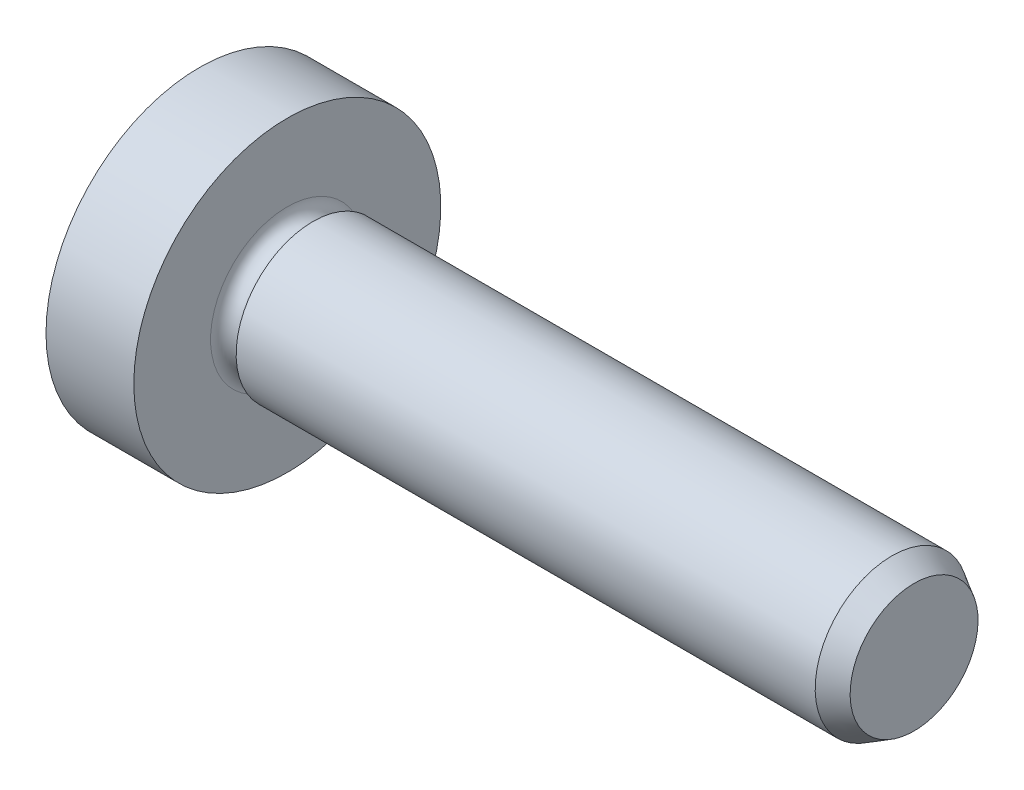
ISO-10303-21;
HEADER;
FILE_DESCRIPTION(('STEP AP214'),'2;1');
FILE_NAME('part.step','',(''),(''),'','','');
FILE_SCHEMA(('AUTOMOTIVE_DESIGN { 1 0 10303 214 1 1 1 1 }'));
ENDSEC;
DATA;
#1=APPLICATION_CONTEXT('core data for automotive mechanical design processes');
#2=APPLICATION_PROTOCOL_DEFINITION('international standard','automotive_design',2000,#1);
#3=PRODUCT_CONTEXT('',#1,'mechanical');
#4=PRODUCT('Part','Part','',(#3));
#5=PRODUCT_RELATED_PRODUCT_CATEGORY('part','',(#4));
#6=PRODUCT_DEFINITION_FORMATION('','',#4);
#7=PRODUCT_DEFINITION_CONTEXT('part definition',#1,'design');
#8=PRODUCT_DEFINITION('design','',#6,#7);
#9=PRODUCT_DEFINITION_SHAPE('','',#8);
#10=(LENGTH_UNIT() NAMED_UNIT(*) SI_UNIT(.MILLI.,.METRE.));
#11=(NAMED_UNIT(*) PLANE_ANGLE_UNIT() SI_UNIT($,.RADIAN.));
#12=(NAMED_UNIT(*) SI_UNIT($,.STERADIAN.) SOLID_ANGLE_UNIT());
#13=UNCERTAINTY_MEASURE_WITH_UNIT(LENGTH_MEASURE(1.E-05),#10,'distance_accuracy_value','');
#14=(GEOMETRIC_REPRESENTATION_CONTEXT(3) GLOBAL_UNCERTAINTY_ASSIGNED_CONTEXT((#13)) GLOBAL_UNIT_ASSIGNED_CONTEXT((#10,
#11,#12)) REPRESENTATION_CONTEXT('',''));
#15=CARTESIAN_POINT('',(0.,0.,0.));
#16=DIRECTION('',(0.,0.,1.));
#17=DIRECTION('',(1.,0.,0.));
#18=AXIS2_PLACEMENT_3D('',#15,#16,#17);
#19=CARTESIAN_POINT('',(16.,0.,0.));
#20=DIRECTION('',(-1.,0.,0.));
#21=DIRECTION('',(0.,1.,0.));
#22=AXIS2_PLACEMENT_3D('',#19,#20,#21);
#23=SPHERICAL_SURFACE('',#22,16.);
#24=CARTESIAN_POINT('',(1.16760302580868,0.,0.));
#25=DIRECTION('',(-1.,0.,0.));
#26=DIRECTION('',(0.,0.,1.));
#27=AXIS2_PLACEMENT_3D('',#24,#25,#26);
#28=CIRCLE('',#27,6.);
#29=CARTESIAN_POINT('',(1.16760302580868,0.,6.));
#30=VERTEX_POINT('',#29);
#31=EDGE_CURVE('E133',#30,#30,#28,.T.);
#32=ORIENTED_EDGE('',*,*,#31,.T.);
#33=EDGE_LOOP('',(#32));
#34=FACE_BOUND('',#33,.T.);
#35=CARTESIAN_POINT('',(16.,0.,-0.690000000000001));
#36=DIRECTION('',(0.,0.,1.));
#37=DIRECTION('',(0.,-1.,0.));
#38=AXIS2_PLACEMENT_3D('',#35,#36,#37);
#39=CIRCLE('',#38,15.9851149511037);
#40=CARTESIAN_POINT('',(0.348506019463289,3.24878995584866,-0.69));
#41=VERTEX_POINT('',#40);
#42=CARTESIAN_POINT('',(0.0297839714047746,0.689999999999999,-0.690000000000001));
#43=VERTEX_POINT('',#42);
#44=EDGE_CURVE('E12',#41,#43,#39,.T.);
#45=ORIENTED_EDGE('',*,*,#44,.F.);
#46=CARTESIAN_POINT('',(13.4938938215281,-4.34070323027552,0.));
#47=DIRECTION('',(-0.500000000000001,-0.866025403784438,0.));
#48=DIRECTION('',(0.866025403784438,-0.500000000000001,0.));
#49=AXIS2_PLACEMENT_3D('',#46,#47,#48);
#50=CIRCLE('',#49,15.1946611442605);
#51=CARTESIAN_POINT('',(0.348506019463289,3.24878995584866,0.689999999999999));
#52=VERTEX_POINT('',#51);
#53=EDGE_CURVE('E48',#52,#41,#50,.T.);
#54=ORIENTED_EDGE('',*,*,#53,.F.);
#55=CARTESIAN_POINT('',(16.,0.,0.689999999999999));
#56=DIRECTION('',(0.,0.,-1.));
#57=DIRECTION('',(0.,1.,0.));
#58=AXIS2_PLACEMENT_3D('',#55,#56,#57);
#59=CIRCLE('',#58,15.9851149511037);
#60=CARTESIAN_POINT('',(0.0297839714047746,0.689999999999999,0.689999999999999));
#61=VERTEX_POINT('',#60);
#62=EDGE_CURVE('E145',#61,#52,#59,.T.);
#63=ORIENTED_EDGE('',*,*,#62,.F.);
#64=CARTESIAN_POINT('',(16.,0.689999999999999,0.));
#65=DIRECTION('',(0.,-1.,0.));
#66=DIRECTION('',(0.,0.,-1.));
#67=AXIS2_PLACEMENT_3D('',#64,#65,#66);
#68=CIRCLE('',#67,15.9851149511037);
#69=CARTESIAN_POINT('',(0.348506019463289,0.689999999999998,3.24878995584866));
#70=VERTEX_POINT('',#69);
#71=EDGE_CURVE('E186',#70,#61,#68,.T.);
#72=ORIENTED_EDGE('',*,*,#71,.F.);
#73=CARTESIAN_POINT('',(13.4938938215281,0.,-4.34070323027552));
#74=DIRECTION('',(-0.500000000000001,0.,-0.866025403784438));
#75=DIRECTION('',(-0.866025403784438,0.,0.500000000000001));
#76=AXIS2_PLACEMENT_3D('',#73,#74,#75);
#77=CIRCLE('',#76,15.1946611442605);
#78=CARTESIAN_POINT('',(0.348506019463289,-0.690000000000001,3.24878995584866));
#79=VERTEX_POINT('',#78);
#80=EDGE_CURVE('E185',#79,#70,#77,.T.);
#81=ORIENTED_EDGE('',*,*,#80,.F.);
#82=CARTESIAN_POINT('',(16.,-0.690000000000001,0.));
#83=DIRECTION('',(0.,1.,0.));
#84=DIRECTION('',(0.,0.,1.));
#85=AXIS2_PLACEMENT_3D('',#82,#83,#84);
#86=CIRCLE('',#85,15.9851149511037);
#87=CARTESIAN_POINT('',(0.0297839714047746,-0.690000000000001,0.689999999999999));
#88=VERTEX_POINT('',#87);
#89=EDGE_CURVE('E187',#88,#79,#86,.T.);
#90=ORIENTED_EDGE('',*,*,#89,.F.);
#91=CARTESIAN_POINT('',(16.,0.,0.689999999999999));
#92=DIRECTION('',(0.,0.,-1.));
#93=DIRECTION('',(0.,1.,0.));
#94=AXIS2_PLACEMENT_3D('',#91,#92,#93);
#95=CIRCLE('',#94,15.9851149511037);
#96=CARTESIAN_POINT('',(0.348506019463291,-3.24878995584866,0.689999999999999));
#97=VERTEX_POINT('',#96);
#98=EDGE_CURVE('E174',#97,#88,#95,.T.);
#99=ORIENTED_EDGE('',*,*,#98,.F.);
#100=CARTESIAN_POINT('',(13.4938938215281,4.34070323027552,0.));
#101=DIRECTION('',(-0.500000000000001,0.866025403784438,0.));
#102=DIRECTION('',(-0.866025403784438,-0.500000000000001,0.));
#103=AXIS2_PLACEMENT_3D('',#100,#101,#102);
#104=CIRCLE('',#103,15.1946611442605);
#105=CARTESIAN_POINT('',(0.348506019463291,-3.24878995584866,-0.690000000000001));
#106=VERTEX_POINT('',#105);
#107=EDGE_CURVE('E172',#106,#97,#104,.T.);
#108=ORIENTED_EDGE('',*,*,#107,.F.);
#109=CARTESIAN_POINT('',(16.,0.,-0.690000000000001));
#110=DIRECTION('',(0.,0.,1.));
#111=DIRECTION('',(0.,-1.,0.));
#112=AXIS2_PLACEMENT_3D('',#109,#110,#111);
#113=CIRCLE('',#112,15.9851149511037);
#114=CARTESIAN_POINT('',(0.0297839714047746,-0.690000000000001,-0.690000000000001));
#115=VERTEX_POINT('',#114);
#116=EDGE_CURVE('E175',#115,#106,#113,.T.);
#117=ORIENTED_EDGE('',*,*,#116,.F.);
#118=CARTESIAN_POINT('',(16.,-0.690000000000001,0.));
#119=DIRECTION('',(0.,1.,0.));
#120=DIRECTION('',(0.,0.,1.));
#121=AXIS2_PLACEMENT_3D('',#118,#119,#120);
#122=CIRCLE('',#121,15.9851149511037);
#123=CARTESIAN_POINT('',(0.348506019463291,-0.69,-3.24878995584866));
#124=VERTEX_POINT('',#123);
#125=EDGE_CURVE('E159',#124,#115,#122,.T.);
#126=ORIENTED_EDGE('',*,*,#125,.F.);
#127=CARTESIAN_POINT('',(13.4938938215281,0.,4.34070323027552));
#128=DIRECTION('',(-0.500000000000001,0.,0.866025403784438));
#129=DIRECTION('',(0.866025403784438,0.,0.500000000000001));
#130=AXIS2_PLACEMENT_3D('',#127,#128,#129);
#131=CIRCLE('',#130,15.1946611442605);
#132=CARTESIAN_POINT('',(0.348506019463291,0.689999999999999,-3.24878995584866));
#133=VERTEX_POINT('',#132);
#134=EDGE_CURVE('E157',#133,#124,#131,.T.);
#135=ORIENTED_EDGE('',*,*,#134,.F.);
#136=CARTESIAN_POINT('',(16.,0.689999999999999,0.));
#137=DIRECTION('',(0.,-1.,0.));
#138=DIRECTION('',(0.,0.,-1.));
#139=AXIS2_PLACEMENT_3D('',#136,#137,#138);
#140=CIRCLE('',#139,15.9851149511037);
#141=EDGE_CURVE('E160',#43,#133,#140,.T.);
#142=ORIENTED_EDGE('',*,*,#141,.F.);
#143=EDGE_LOOP('',(#45,#54,#63,#72,#81,#90,#99,#108,#117,#126,#135,#142));
#144=FACE_BOUND('',#143,.T.);
#145=ADVANCED_FACE('F38',(#34,#144),#23,.T.);
#146=CARTESIAN_POINT('',(4.6,3.,0.));
#147=DIRECTION('',(-1.,0.,0.));
#148=DIRECTION('',(0.,0.,1.));
#149=AXIS2_PLACEMENT_3D('',#146,#147,#148);
#150=PLANE('',#149);
#151=CARTESIAN_POINT('',(4.59999999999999,0.,0.));
#152=DIRECTION('',(-1.,0.,0.));
#153=DIRECTION('',(0.,0.,1.));
#154=AXIS2_PLACEMENT_3D('',#151,#152,#153);
#155=CIRCLE('',#154,6.);
#156=CARTESIAN_POINT('',(4.59999999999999,0.,6.));
#157=VERTEX_POINT('',#156);
#158=EDGE_CURVE('E136',#157,#157,#155,.T.);
#159=ORIENTED_EDGE('',*,*,#158,.F.);
#160=EDGE_LOOP('',(#159));
#161=FACE_BOUND('',#160,.T.);
#162=CARTESIAN_POINT('',(4.59999999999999,0.,0.));
#163=DIRECTION('',(1.,0.,0.));
#164=DIRECTION('',(0.,0.,-1.));
#165=AXIS2_PLACEMENT_3D('',#162,#163,#164);
#166=CIRCLE('',#165,3.);
#167=CARTESIAN_POINT('',(4.59999999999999,0.,-3.));
#168=VERTEX_POINT('',#167);
#169=EDGE_CURVE('E221',#168,#168,#166,.T.);
#170=ORIENTED_EDGE('',*,*,#169,.F.);
#171=EDGE_LOOP('',(#170));
#172=FACE_BOUND('',#171,.T.);
#173=ADVANCED_FACE('F238',(#161,#172),#150,.F.);
#174=CARTESIAN_POINT('',(-96.3851955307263,0.,0.));
#175=DIRECTION('',(-1.,0.,0.));
#176=DIRECTION('',(0.,0.,1.));
#177=AXIS2_PLACEMENT_3D('',#174,#175,#176);
#178=CYLINDRICAL_SURFACE('',#177,6.);
#179=ORIENTED_EDGE('',*,*,#31,.F.);
#180=EDGE_LOOP('',(#179));
#181=FACE_BOUND('',#180,.T.);
#182=ORIENTED_EDGE('',*,*,#158,.T.);
#183=EDGE_LOOP('',(#182));
#184=FACE_BOUND('',#183,.T.);
#185=ADVANCED_FACE('F240',(#181,#184),#178,.T.);
#186=CARTESIAN_POINT('',(3.1,3.45,-0.690000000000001));
#187=DIRECTION('',(0.,0.,1.));
#188=DIRECTION('',(0.,-1.,0.));
#189=AXIS2_PLACEMENT_3D('',#186,#187,#188);
#190=PLANE('',#189);
#191=ORIENTED_EDGE('',*,*,#44,.T.);
#192=DIRECTION('',(-1.,0.,0.));
#193=VECTOR('',#192,1.);
#194=CARTESIAN_POINT('',(3.1,0.689999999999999,-0.690000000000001));
#195=LINE('',#194,#193);
#196=CARTESIAN_POINT('',(3.1,0.689999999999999,-0.690000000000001));
#197=VERTEX_POINT('',#196);
#198=EDGE_CURVE('E56',#197,#43,#195,.T.);
#199=ORIENTED_EDGE('',*,*,#198,.F.);
#200=DIRECTION('',(0.,1.,0.));
#201=VECTOR('',#200,1.);
#202=CARTESIAN_POINT('',(3.1,3.45,-0.690000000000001));
#203=LINE('',#202,#201);
#204=CARTESIAN_POINT('',(3.1,1.66021416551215,-0.690000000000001));
#205=VERTEX_POINT('',#204);
#206=EDGE_CURVE('E117',#197,#205,#203,.T.);
#207=ORIENTED_EDGE('',*,*,#206,.T.);
#208=DIRECTION('',(-0.866025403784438,0.500000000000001,0.));
#209=VECTOR('',#208,1.);
#210=CARTESIAN_POINT('',(0.,3.45,-0.690000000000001));
#211=LINE('',#210,#209);
#212=EDGE_CURVE('E42',#205,#41,#211,.T.);
#213=ORIENTED_EDGE('',*,*,#212,.T.);
#214=EDGE_LOOP('',(#191,#199,#207,#213));
#215=FACE_BOUND('',#214,.T.);
#216=ADVANCED_FACE('F127',(#215),#190,.T.);
#217=CARTESIAN_POINT('',(0.,3.45,0.));
#218=DIRECTION('',(-0.500000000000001,-0.866025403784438,0.));
#219=DIRECTION('',(0.866025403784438,-0.500000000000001,0.));
#220=AXIS2_PLACEMENT_3D('',#217,#218,#219);
#221=PLANE('',#220);
#222=ORIENTED_EDGE('',*,*,#53,.T.);
#223=ORIENTED_EDGE('',*,*,#212,.F.);
#224=DIRECTION('',(0.,0.,1.));
#225=VECTOR('',#224,1.);
#226=CARTESIAN_POINT('',(3.1,1.66021416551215,0.));
#227=LINE('',#226,#225);
#228=CARTESIAN_POINT('',(3.1,1.66021416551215,0.689999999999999));
#229=VERTEX_POINT('',#228);
#230=EDGE_CURVE('E113',#205,#229,#227,.T.);
#231=ORIENTED_EDGE('',*,*,#230,.T.);
#232=DIRECTION('',(-0.866025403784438,0.500000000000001,0.));
#233=VECTOR('',#232,1.);
#234=CARTESIAN_POINT('',(2.325,2.10766062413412,0.69));
#235=LINE('',#234,#233);
#236=EDGE_CURVE('E134',#229,#52,#235,.T.);
#237=ORIENTED_EDGE('',*,*,#236,.T.);
#238=EDGE_LOOP('',(#222,#223,#231,#237));
#239=FACE_BOUND('',#238,.T.);
#240=ADVANCED_FACE('F131',(#239),#221,.T.);
#241=CARTESIAN_POINT('',(3.1,3.45,0.69));
#242=DIRECTION('',(0.,0.,-1.));
#243=DIRECTION('',(0.,1.,0.));
#244=AXIS2_PLACEMENT_3D('',#241,#242,#243);
#245=PLANE('',#244);
#246=ORIENTED_EDGE('',*,*,#62,.T.);
#247=ORIENTED_EDGE('',*,*,#236,.F.);
#248=DIRECTION('',(0.,-1.,0.));
#249=VECTOR('',#248,1.);
#250=CARTESIAN_POINT('',(3.1,3.45,0.69));
#251=LINE('',#250,#249);
#252=CARTESIAN_POINT('',(3.1,0.689999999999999,0.689999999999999));
#253=VERTEX_POINT('',#252);
#254=EDGE_CURVE('E120',#229,#253,#251,.T.);
#255=ORIENTED_EDGE('',*,*,#254,.T.);
#256=DIRECTION('',(-1.,0.,0.));
#257=VECTOR('',#256,1.);
#258=CARTESIAN_POINT('',(3.1,0.689999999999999,0.689999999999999));
#259=LINE('',#258,#257);
#260=EDGE_CURVE('E138',#253,#61,#259,.T.);
#261=ORIENTED_EDGE('',*,*,#260,.T.);
#262=EDGE_LOOP('',(#246,#247,#255,#261));
#263=FACE_BOUND('',#262,.T.);
#264=ADVANCED_FACE('F266',(#263),#245,.T.);
#265=CARTESIAN_POINT('',(3.1,0.689999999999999,0.689999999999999));
#266=DIRECTION('',(0.,-1.,0.));
#267=DIRECTION('',(0.,0.,-1.));
#268=AXIS2_PLACEMENT_3D('',#265,#266,#267);
#269=PLANE('',#268);
#270=ORIENTED_EDGE('',*,*,#71,.T.);
#271=ORIENTED_EDGE('',*,*,#260,.F.);
#272=DIRECTION('',(0.,0.,1.));
#273=VECTOR('',#272,1.);
#274=CARTESIAN_POINT('',(3.1,0.689999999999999,0.689999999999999));
#275=LINE('',#274,#273);
#276=CARTESIAN_POINT('',(3.1,0.689999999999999,1.66021416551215));
#277=VERTEX_POINT('',#276);
#278=EDGE_CURVE('E182',#253,#277,#275,.T.);
#279=ORIENTED_EDGE('',*,*,#278,.T.);
#280=DIRECTION('',(-0.866025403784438,0.,0.500000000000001));
#281=VECTOR('',#280,1.);
#282=CARTESIAN_POINT('',(0.,0.689999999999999,3.45));
#283=LINE('',#282,#281);
#284=EDGE_CURVE('E141',#277,#70,#283,.T.);
#285=ORIENTED_EDGE('',*,*,#284,.T.);
#286=EDGE_LOOP('',(#270,#271,#279,#285));
#287=FACE_BOUND('',#286,.T.);
#288=ADVANCED_FACE('F263',(#287),#269,.T.);
#289=CARTESIAN_POINT('',(0.,0.,3.45));
#290=DIRECTION('',(-0.500000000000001,0.,-0.866025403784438));
#291=DIRECTION('',(-0.866025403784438,0.,0.500000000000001));
#292=AXIS2_PLACEMENT_3D('',#289,#290,#291);
#293=PLANE('',#292);
#294=ORIENTED_EDGE('',*,*,#80,.T.);
#295=ORIENTED_EDGE('',*,*,#284,.F.);
#296=DIRECTION('',(0.,-1.,0.));
#297=VECTOR('',#296,1.);
#298=CARTESIAN_POINT('',(3.1,0.,1.66021416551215));
#299=LINE('',#298,#297);
#300=CARTESIAN_POINT('',(3.1,-0.690000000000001,1.66021416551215));
#301=VERTEX_POINT('',#300);
#302=EDGE_CURVE('E179',#277,#301,#299,.T.);
#303=ORIENTED_EDGE('',*,*,#302,.T.);
#304=DIRECTION('',(-0.866025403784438,0.,0.500000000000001));
#305=VECTOR('',#304,1.);
#306=CARTESIAN_POINT('',(3.52011505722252,-0.690000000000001,1.41766062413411));
#307=LINE('',#306,#305);
#308=EDGE_CURVE('E178',#301,#79,#307,.T.);
#309=ORIENTED_EDGE('',*,*,#308,.T.);
#310=EDGE_LOOP('',(#294,#295,#303,#309));
#311=FACE_BOUND('',#310,.T.);
#312=ADVANCED_FACE('F259',(#311),#293,.T.);
#313=CARTESIAN_POINT('',(3.1,-0.690000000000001,0.689999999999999));
#314=DIRECTION('',(0.,1.,0.));
#315=DIRECTION('',(0.,0.,1.));
#316=AXIS2_PLACEMENT_3D('',#313,#314,#315);
#317=PLANE('',#316);
#318=ORIENTED_EDGE('',*,*,#89,.T.);
#319=ORIENTED_EDGE('',*,*,#308,.F.);
#320=DIRECTION('',(0.,0.,-1.));
#321=VECTOR('',#320,1.);
#322=CARTESIAN_POINT('',(3.1,-0.690000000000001,0.689999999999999));
#323=LINE('',#322,#321);
#324=CARTESIAN_POINT('',(3.1,-0.690000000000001,0.689999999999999));
#325=VERTEX_POINT('',#324);
#326=EDGE_CURVE('E181',#301,#325,#323,.T.);
#327=ORIENTED_EDGE('',*,*,#326,.T.);
#328=DIRECTION('',(-1.,0.,0.));
#329=VECTOR('',#328,1.);
#330=CARTESIAN_POINT('',(3.1,-0.690000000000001,0.689999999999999));
#331=LINE('',#330,#329);
#332=EDGE_CURVE('E164',#325,#88,#331,.T.);
#333=ORIENTED_EDGE('',*,*,#332,.T.);
#334=EDGE_LOOP('',(#318,#319,#327,#333));
#335=FACE_BOUND('',#334,.T.);
#336=ADVANCED_FACE('F262',(#335),#317,.T.);
#337=CARTESIAN_POINT('',(3.1,-3.45,0.689999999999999));
#338=DIRECTION('',(0.,0.,-1.));
#339=DIRECTION('',(0.,1.,0.));
#340=AXIS2_PLACEMENT_3D('',#337,#338,#339);
#341=PLANE('',#340);
#342=ORIENTED_EDGE('',*,*,#98,.T.);
#343=ORIENTED_EDGE('',*,*,#332,.F.);
#344=DIRECTION('',(0.,-1.,0.));
#345=VECTOR('',#344,1.);
#346=CARTESIAN_POINT('',(3.1,-3.45,0.689999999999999));
#347=LINE('',#346,#345);
#348=CARTESIAN_POINT('',(3.1,-1.66021416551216,0.689999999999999));
#349=VERTEX_POINT('',#348);
#350=EDGE_CURVE('E169',#325,#349,#347,.T.);
#351=ORIENTED_EDGE('',*,*,#350,.T.);
#352=DIRECTION('',(-0.866025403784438,-0.500000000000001,0.));
#353=VECTOR('',#352,1.);
#354=CARTESIAN_POINT('',(0.,-3.45,0.689999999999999));
#355=LINE('',#354,#353);
#356=EDGE_CURVE('E161',#349,#97,#355,.T.);
#357=ORIENTED_EDGE('',*,*,#356,.T.);
#358=EDGE_LOOP('',(#342,#343,#351,#357));
#359=FACE_BOUND('',#358,.T.);
#360=ADVANCED_FACE('F307',(#359),#341,.T.);
#361=CARTESIAN_POINT('',(0.,-3.45,0.));
#362=DIRECTION('',(-0.500000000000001,0.866025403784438,0.));
#363=DIRECTION('',(-0.866025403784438,-0.500000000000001,0.));
#364=AXIS2_PLACEMENT_3D('',#361,#362,#363);
#365=PLANE('',#364);
#366=ORIENTED_EDGE('',*,*,#107,.T.);
#367=ORIENTED_EDGE('',*,*,#356,.F.);
#368=DIRECTION('',(0.,0.,-1.));
#369=VECTOR('',#368,1.);
#370=CARTESIAN_POINT('',(3.1,-1.66021416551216,0.));
#371=LINE('',#370,#369);
#372=CARTESIAN_POINT('',(3.1,-1.66021416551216,-0.690000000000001));
#373=VERTEX_POINT('',#372);
#374=EDGE_CURVE('E166',#349,#373,#371,.T.);
#375=ORIENTED_EDGE('',*,*,#374,.T.);
#376=DIRECTION('',(-0.866025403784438,-0.500000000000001,0.));
#377=VECTOR('',#376,1.);
#378=CARTESIAN_POINT('',(2.325,-2.10766062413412,-0.690000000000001));
#379=LINE('',#378,#377);
#380=EDGE_CURVE('E165',#373,#106,#379,.T.);
#381=ORIENTED_EDGE('',*,*,#380,.T.);
#382=EDGE_LOOP('',(#366,#367,#375,#381));
#383=FACE_BOUND('',#382,.T.);
#384=ADVANCED_FACE('F40',(#383),#365,.T.);
#385=CARTESIAN_POINT('',(3.1,-3.45,-0.690000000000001));
#386=DIRECTION('',(0.,0.,1.));
#387=DIRECTION('',(0.,-1.,0.));
#388=AXIS2_PLACEMENT_3D('',#385,#386,#387);
#389=PLANE('',#388);
#390=ORIENTED_EDGE('',*,*,#116,.T.);
#391=ORIENTED_EDGE('',*,*,#380,.F.);
#392=DIRECTION('',(0.,1.,0.));
#393=VECTOR('',#392,1.);
#394=CARTESIAN_POINT('',(3.1,-3.45,-0.690000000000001));
#395=LINE('',#394,#393);
#396=CARTESIAN_POINT('',(3.1,-0.690000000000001,-0.690000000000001));
#397=VERTEX_POINT('',#396);
#398=EDGE_CURVE('E168',#373,#397,#395,.T.);
#399=ORIENTED_EDGE('',*,*,#398,.T.);
#400=DIRECTION('',(-1.,0.,0.));
#401=VECTOR('',#400,1.);
#402=CARTESIAN_POINT('',(3.1,-0.690000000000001,-0.690000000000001));
#403=LINE('',#402,#401);
#404=EDGE_CURVE('E149',#397,#115,#403,.T.);
#405=ORIENTED_EDGE('',*,*,#404,.T.);
#406=EDGE_LOOP('',(#390,#391,#399,#405));
#407=FACE_BOUND('',#406,.T.);
#408=ADVANCED_FACE('F277',(#407),#389,.T.);
#409=CARTESIAN_POINT('',(3.1,-0.690000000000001,-0.690000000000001));
#410=DIRECTION('',(0.,1.,0.));
#411=DIRECTION('',(0.,0.,1.));
#412=AXIS2_PLACEMENT_3D('',#409,#410,#411);
#413=PLANE('',#412);
#414=ORIENTED_EDGE('',*,*,#125,.T.);
#415=ORIENTED_EDGE('',*,*,#404,.F.);
#416=DIRECTION('',(0.,0.,-1.));
#417=VECTOR('',#416,1.);
#418=CARTESIAN_POINT('',(3.1,-0.690000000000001,-0.690000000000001));
#419=LINE('',#418,#417);
#420=CARTESIAN_POINT('',(3.1,-0.690000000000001,-1.66021416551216));
#421=VERTEX_POINT('',#420);
#422=EDGE_CURVE('E154',#397,#421,#419,.T.);
#423=ORIENTED_EDGE('',*,*,#422,.T.);
#424=DIRECTION('',(-0.866025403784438,0.,-0.500000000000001));
#425=VECTOR('',#424,1.);
#426=CARTESIAN_POINT('',(0.,-0.69,-3.45));
#427=LINE('',#426,#425);
#428=EDGE_CURVE('E146',#421,#124,#427,.T.);
#429=ORIENTED_EDGE('',*,*,#428,.T.);
#430=EDGE_LOOP('',(#414,#415,#423,#429));
#431=FACE_BOUND('',#430,.T.);
#432=ADVANCED_FACE('F270',(#431),#413,.T.);
#433=CARTESIAN_POINT('',(0.,0.,-3.45));
#434=DIRECTION('',(-0.500000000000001,0.,0.866025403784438));
#435=DIRECTION('',(0.866025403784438,0.,0.500000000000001));
#436=AXIS2_PLACEMENT_3D('',#433,#434,#435);
#437=PLANE('',#436);
#438=ORIENTED_EDGE('',*,*,#134,.T.);
#439=ORIENTED_EDGE('',*,*,#428,.F.);
#440=DIRECTION('',(0.,1.,0.));
#441=VECTOR('',#440,1.);
#442=CARTESIAN_POINT('',(3.1,0.,-1.66021416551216));
#443=LINE('',#442,#441);
#444=CARTESIAN_POINT('',(3.1,0.689999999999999,-1.66021416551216));
#445=VERTEX_POINT('',#444);
#446=EDGE_CURVE('E151',#421,#445,#443,.T.);
#447=ORIENTED_EDGE('',*,*,#446,.T.);
#448=DIRECTION('',(-0.866025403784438,0.,-0.500000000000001));
#449=VECTOR('',#448,1.);
#450=CARTESIAN_POINT('',(3.52011505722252,0.689999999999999,-1.41766062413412));
#451=LINE('',#450,#449);
#452=EDGE_CURVE('E150',#445,#133,#451,.T.);
#453=ORIENTED_EDGE('',*,*,#452,.T.);
#454=EDGE_LOOP('',(#438,#439,#447,#453));
#455=FACE_BOUND('',#454,.T.);
#456=ADVANCED_FACE('F267',(#455),#437,.T.);
#457=CARTESIAN_POINT('',(3.1,0.689999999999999,-0.690000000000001));
#458=DIRECTION('',(0.,-1.,0.));
#459=DIRECTION('',(0.,0.,-1.));
#460=AXIS2_PLACEMENT_3D('',#457,#458,#459);
#461=PLANE('',#460);
#462=ORIENTED_EDGE('',*,*,#141,.T.);
#463=ORIENTED_EDGE('',*,*,#452,.F.);
#464=DIRECTION('',(0.,0.,1.));
#465=VECTOR('',#464,1.);
#466=CARTESIAN_POINT('',(3.1,0.689999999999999,-0.690000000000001));
#467=LINE('',#466,#465);
#468=EDGE_CURVE('E153',#445,#197,#467,.T.);
#469=ORIENTED_EDGE('',*,*,#468,.T.);
#470=ORIENTED_EDGE('',*,*,#198,.T.);
#471=EDGE_LOOP('',(#462,#463,#469,#470));
#472=FACE_BOUND('',#471,.T.);
#473=ADVANCED_FACE('F269',(#472),#461,.T.);
#474=CARTESIAN_POINT('',(3.1,0.689999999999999,-0.690000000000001));
#475=DIRECTION('',(1.,0.,0.));
#476=DIRECTION('',(0.,0.,-1.));
#477=AXIS2_PLACEMENT_3D('',#474,#475,#476);
#478=PLANE('',#477);
#479=ORIENTED_EDGE('',*,*,#206,.F.);
#480=ORIENTED_EDGE('',*,*,#468,.F.);
#481=ORIENTED_EDGE('',*,*,#446,.F.);
#482=ORIENTED_EDGE('',*,*,#422,.F.);
#483=ORIENTED_EDGE('',*,*,#398,.F.);
#484=ORIENTED_EDGE('',*,*,#374,.F.);
#485=ORIENTED_EDGE('',*,*,#350,.F.);
#486=ORIENTED_EDGE('',*,*,#326,.F.);
#487=ORIENTED_EDGE('',*,*,#302,.F.);
#488=ORIENTED_EDGE('',*,*,#278,.F.);
#489=ORIENTED_EDGE('',*,*,#254,.F.);
#490=ORIENTED_EDGE('',*,*,#230,.F.);
#491=EDGE_LOOP('',(#479,#480,#481,#482,#483,#484,#485,#486,#487,#488,#489,#490));
#492=FACE_BOUND('',#491,.T.);
#493=ADVANCED_FACE('F115',(#492),#478,.F.);
#494=CARTESIAN_POINT('',(5.09999999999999,0.,0.));
#495=DIRECTION('',(1.,0.,0.));
#496=DIRECTION('',(0.,0.,-1.));
#497=AXIS2_PLACEMENT_3D('',#494,#495,#496);
#498=TOROIDAL_SURFACE('',#497,3.,0.5);
#499=CARTESIAN_POINT('',(5.59999999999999,0.,0.));
#500=DIRECTION('',(1.,0.,0.));
#501=DIRECTION('',(0.,0.,-1.));
#502=AXIS2_PLACEMENT_3D('',#499,#500,#501);
#503=CIRCLE('',#502,3.);
#504=CARTESIAN_POINT('',(5.59999999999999,0.,-3.));
#505=VERTEX_POINT('',#504);
#506=EDGE_CURVE('E224',#505,#505,#503,.T.);
#507=ORIENTED_EDGE('',*,*,#506,.F.);
#508=EDGE_LOOP('',(#507));
#509=FACE_BOUND('',#508,.T.);
#510=ORIENTED_EDGE('',*,*,#169,.T.);
#511=EDGE_LOOP('',(#510));
#512=FACE_BOUND('',#511,.T.);
#513=ADVANCED_FACE('F231',(#509,#512),#498,.F.);
#514=CARTESIAN_POINT('',(29.1,0.,0.));
#515=DIRECTION('',(-1.,0.,0.));
#516=DIRECTION('',(0.,0.,1.));
#517=AXIS2_PLACEMENT_3D('',#514,#515,#516);
#518=PLANE('',#517);
#519=CARTESIAN_POINT('',(29.1,0.,0.));
#520=DIRECTION('',(1.,0.,0.));
#521=DIRECTION('',(0.,1.,0.));
#522=AXIS2_PLACEMENT_3D('',#519,#520,#521);
#523=CIRCLE('',#522,2.5);
#524=CARTESIAN_POINT('',(29.1,2.5,0.));
#525=VERTEX_POINT('',#524);
#526=EDGE_CURVE('E129',#525,#525,#523,.T.);
#527=ORIENTED_EDGE('',*,*,#526,.T.);
#528=EDGE_LOOP('',(#527));
#529=FACE_BOUND('',#528,.T.);
#530=ADVANCED_FACE('F234',(#529),#518,.F.);
#531=CARTESIAN_POINT('',(29.1,0.,0.));
#532=DIRECTION('',(-1.,0.,0.));
#533=DIRECTION('',(0.,-1.,0.));
#534=AXIS2_PLACEMENT_3D('',#531,#532,#533);
#535=CONICAL_SURFACE('',#534,2.5,0.523598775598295);
#536=CARTESIAN_POINT('',(28.2339745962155,0.,0.));
#537=DIRECTION('',(1.,0.,0.));
#538=DIRECTION('',(0.,1.,0.));
#539=AXIS2_PLACEMENT_3D('',#536,#537,#538);
#540=CIRCLE('',#539,3.);
#541=CARTESIAN_POINT('',(28.2339745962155,3.00000000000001,0.));
#542=VERTEX_POINT('',#541);
#543=EDGE_CURVE('E218',#542,#542,#540,.T.);
#544=ORIENTED_EDGE('',*,*,#543,.T.);
#545=EDGE_LOOP('',(#544));
#546=FACE_BOUND('',#545,.T.);
#547=ORIENTED_EDGE('',*,*,#526,.F.);
#548=EDGE_LOOP('',(#547));
#549=FACE_BOUND('',#548,.T.);
#550=ADVANCED_FACE('F255',(#546,#549),#535,.T.);
#551=CARTESIAN_POINT('',(-96.3851955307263,0.,0.));
#552=DIRECTION('',(-1.,0.,0.));
#553=DIRECTION('',(0.,0.,1.));
#554=AXIS2_PLACEMENT_3D('',#551,#552,#553);
#555=CYLINDRICAL_SURFACE('',#554,3.);
#556=ORIENTED_EDGE('',*,*,#506,.T.);
#557=EDGE_LOOP('',(#556));
#558=FACE_BOUND('',#557,.T.);
#559=ORIENTED_EDGE('',*,*,#543,.F.);
#560=EDGE_LOOP('',(#559));
#561=FACE_BOUND('',#560,.T.);
#562=ADVANCED_FACE('F228',(#558,#561),#555,.T.);
#563=CLOSED_SHELL('',(#145,#173,#185,#216,#240,#264,#288,#312,#336,#360,#384,#408,#432,#456,
#473,#493,#513,#530,#550,#562));
#564=MANIFOLD_SOLID_BREP('B2',#563);
#565=ADVANCED_BREP_SHAPE_REPRESENTATION('',(#18,#564),#14);
#566=SHAPE_DEFINITION_REPRESENTATION(#9,#565);
ENDSEC;
END-ISO-10303-21;
